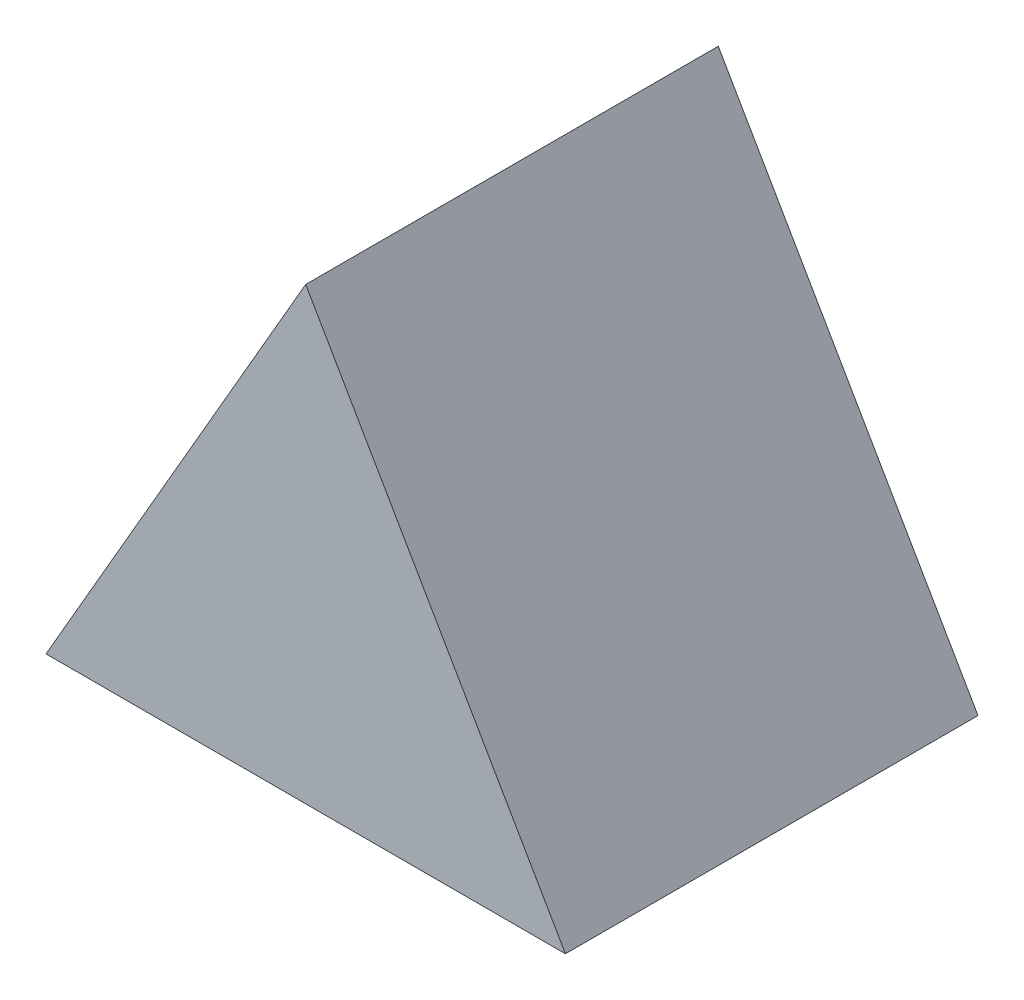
ISO-10303-21;
HEADER;
FILE_DESCRIPTION(('STEP AP214'),'2;1');
FILE_NAME('part.step','',(''),(''),'','','');
FILE_SCHEMA(('AUTOMOTIVE_DESIGN { 1 0 10303 214 1 1 1 1 }'));
ENDSEC;
DATA;
#1=APPLICATION_CONTEXT('core data for automotive mechanical design processes');
#2=APPLICATION_PROTOCOL_DEFINITION('international standard','automotive_design',2000,#1);
#3=PRODUCT_CONTEXT('',#1,'mechanical');
#4=PRODUCT('Part','Part','',(#3));
#5=PRODUCT_RELATED_PRODUCT_CATEGORY('part','',(#4));
#6=PRODUCT_DEFINITION_FORMATION('','',#4);
#7=PRODUCT_DEFINITION_CONTEXT('part definition',#1,'design');
#8=PRODUCT_DEFINITION('design','',#6,#7);
#9=PRODUCT_DEFINITION_SHAPE('','',#8);
#10=(LENGTH_UNIT() NAMED_UNIT(*) SI_UNIT(.MILLI.,.METRE.));
#11=(NAMED_UNIT(*) PLANE_ANGLE_UNIT() SI_UNIT($,.RADIAN.));
#12=(NAMED_UNIT(*) SI_UNIT($,.STERADIAN.) SOLID_ANGLE_UNIT());
#13=UNCERTAINTY_MEASURE_WITH_UNIT(LENGTH_MEASURE(1.E-05),#10,'distance_accuracy_value','');
#14=(GEOMETRIC_REPRESENTATION_CONTEXT(3) GLOBAL_UNCERTAINTY_ASSIGNED_CONTEXT((#13)) GLOBAL_UNIT_ASSIGNED_CONTEXT((#10,
#11,#12)) REPRESENTATION_CONTEXT('',''));
#15=CARTESIAN_POINT('',(0.,0.,0.));
#16=DIRECTION('',(0.,0.,1.));
#17=DIRECTION('',(1.,0.,0.));
#18=AXIS2_PLACEMENT_3D('',#15,#16,#17);
#19=CARTESIAN_POINT('',(28.9433565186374,-39.3678705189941,34.29));
#20=DIRECTION('',(0.,1.,0.));
#21=DIRECTION('',(0.,0.,1.));
#22=AXIS2_PLACEMENT_3D('',#19,#20,#21);
#23=PLANE('',#22);
#24=DIRECTION('',(1.,0.,0.));
#25=VECTOR('',#24,1.);
#26=CARTESIAN_POINT('',(28.9433565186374,-39.3678705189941,0.));
#27=LINE('',#26,#25);
#28=CARTESIAN_POINT('',(-14.2263955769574,-39.3678705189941,0.));
#29=VERTEX_POINT('',#28);
#30=CARTESIAN_POINT('',(28.9433565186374,-39.3678705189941,0.));
#31=VERTEX_POINT('',#30);
#32=EDGE_CURVE('E62',#29,#31,#27,.T.);
#33=ORIENTED_EDGE('',*,*,#32,.T.);
#34=DIRECTION('',(0.,0.,-1.));
#35=VECTOR('',#34,1.);
#36=CARTESIAN_POINT('',(28.9433565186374,-39.3678705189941,34.29));
#37=LINE('',#36,#35);
#38=CARTESIAN_POINT('',(28.9433565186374,-39.3678705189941,34.29));
#39=VERTEX_POINT('',#38);
#40=EDGE_CURVE('E11',#39,#31,#37,.T.);
#41=ORIENTED_EDGE('',*,*,#40,.F.);
#42=DIRECTION('',(1.,0.,0.));
#43=VECTOR('',#42,1.);
#44=CARTESIAN_POINT('',(28.9433565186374,-39.3678705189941,34.29));
#45=LINE('',#44,#43);
#46=CARTESIAN_POINT('',(-14.2263955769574,-39.3678705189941,34.29));
#47=VERTEX_POINT('',#46);
#48=EDGE_CURVE('E76',#47,#39,#45,.T.);
#49=ORIENTED_EDGE('',*,*,#48,.F.);
#50=DIRECTION('',(0.,0.,-1.));
#51=VECTOR('',#50,1.);
#52=CARTESIAN_POINT('',(-14.2263955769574,-39.3678705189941,34.29));
#53=LINE('',#52,#51);
#54=EDGE_CURVE('E72',#47,#29,#53,.T.);
#55=ORIENTED_EDGE('',*,*,#54,.T.);
#56=EDGE_LOOP('',(#33,#41,#49,#55));
#57=FACE_BOUND('',#56,.T.);
#58=ADVANCED_FACE('F26',(#57),#23,.F.);
#59=CARTESIAN_POINT('',(7.35848047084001,-1.98176852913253,34.29));
#60=DIRECTION('',(-0.866025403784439,-0.5,0.));
#61=DIRECTION('',(0.5,-0.866025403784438,0.));
#62=AXIS2_PLACEMENT_3D('',#59,#60,#61);
#63=PLANE('',#62);
#64=DIRECTION('',(-0.5,0.866025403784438,0.));
#65=VECTOR('',#64,1.);
#66=CARTESIAN_POINT('',(7.35848047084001,-1.98176852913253,0.));
#67=LINE('',#66,#65);
#68=CARTESIAN_POINT('',(7.35848047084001,-1.98176852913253,0.));
#69=VERTEX_POINT('',#68);
#70=EDGE_CURVE('E59',#31,#69,#67,.T.);
#71=ORIENTED_EDGE('',*,*,#70,.T.);
#72=DIRECTION('',(0.,0.,-1.));
#73=VECTOR('',#72,1.);
#74=CARTESIAN_POINT('',(7.35848047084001,-1.98176852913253,34.29));
#75=LINE('',#74,#73);
#76=CARTESIAN_POINT('',(7.35848047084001,-1.98176852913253,34.29));
#77=VERTEX_POINT('',#76);
#78=EDGE_CURVE('E33',#77,#69,#75,.T.);
#79=ORIENTED_EDGE('',*,*,#78,.F.);
#80=DIRECTION('',(-0.5,0.866025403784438,0.));
#81=VECTOR('',#80,1.);
#82=CARTESIAN_POINT('',(7.35848047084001,-1.98176852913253,34.29));
#83=LINE('',#82,#81);
#84=EDGE_CURVE('E44',#39,#77,#83,.T.);
#85=ORIENTED_EDGE('',*,*,#84,.F.);
#86=ORIENTED_EDGE('',*,*,#40,.T.);
#87=EDGE_LOOP('',(#71,#79,#85,#86));
#88=FACE_BOUND('',#87,.T.);
#89=ADVANCED_FACE('F68',(#88),#63,.F.);
#90=CARTESIAN_POINT('',(-14.2263955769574,-39.3678705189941,34.29));
#91=DIRECTION('',(0.866025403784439,-0.5,0.));
#92=DIRECTION('',(0.5,0.866025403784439,0.));
#93=AXIS2_PLACEMENT_3D('',#90,#91,#92);
#94=PLANE('',#93);
#95=DIRECTION('',(-0.5,-0.866025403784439,0.));
#96=VECTOR('',#95,1.);
#97=CARTESIAN_POINT('',(-14.2263955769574,-39.3678705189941,0.));
#98=LINE('',#97,#96);
#99=EDGE_CURVE('E63',#69,#29,#98,.T.);
#100=ORIENTED_EDGE('',*,*,#99,.T.);
#101=ORIENTED_EDGE('',*,*,#54,.F.);
#102=DIRECTION('',(-0.5,-0.866025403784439,0.));
#103=VECTOR('',#102,1.);
#104=CARTESIAN_POINT('',(-14.2263955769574,-39.3678705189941,34.29));
#105=LINE('',#104,#103);
#106=EDGE_CURVE('E40',#77,#47,#105,.T.);
#107=ORIENTED_EDGE('',*,*,#106,.F.);
#108=ORIENTED_EDGE('',*,*,#78,.T.);
#109=EDGE_LOOP('',(#100,#101,#107,#108));
#110=FACE_BOUND('',#109,.T.);
#111=ADVANCED_FACE('F81',(#110),#94,.F.);
#112=CARTESIAN_POINT('',(-14.2263955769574,-39.3678705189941,34.29));
#113=DIRECTION('',(0.,0.,-1.));
#114=DIRECTION('',(-1.,0.,0.));
#115=AXIS2_PLACEMENT_3D('',#112,#113,#114);
#116=PLANE('',#115);
#117=ORIENTED_EDGE('',*,*,#48,.T.);
#118=ORIENTED_EDGE('',*,*,#84,.T.);
#119=ORIENTED_EDGE('',*,*,#106,.T.);
#120=EDGE_LOOP('',(#117,#118,#119));
#121=FACE_BOUND('',#120,.T.);
#122=ADVANCED_FACE('F82',(#121),#116,.F.);
#123=CARTESIAN_POINT('',(-14.2263955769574,-39.3678705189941,0.));
#124=DIRECTION('',(0.,0.,-1.));
#125=DIRECTION('',(-1.,0.,0.));
#126=AXIS2_PLACEMENT_3D('',#123,#124,#125);
#127=PLANE('',#126);
#128=ORIENTED_EDGE('',*,*,#32,.F.);
#129=ORIENTED_EDGE('',*,*,#99,.F.);
#130=ORIENTED_EDGE('',*,*,#70,.F.);
#131=EDGE_LOOP('',(#128,#129,#130));
#132=FACE_BOUND('',#131,.T.);
#133=ADVANCED_FACE('F60',(#132),#127,.T.);
#134=CLOSED_SHELL('',(#58,#89,#111,#122,#133));
#135=MANIFOLD_SOLID_BREP('B2',#134);
#136=ADVANCED_BREP_SHAPE_REPRESENTATION('',(#18,#135),#14);
#137=SHAPE_DEFINITION_REPRESENTATION(#9,#136);
ENDSEC;
END-ISO-10303-21;
